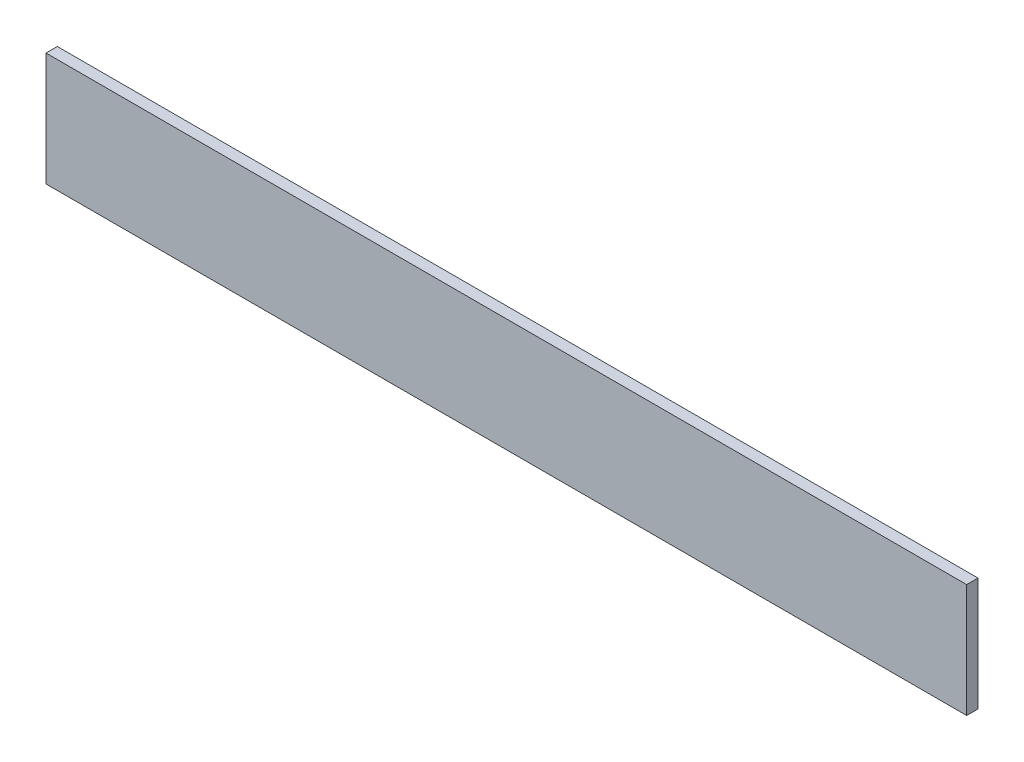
from build123d import *

# Parameters (mm, degrees)
ESQUISSE1_W      = 812
ESQUISSE1_H      = 100
EXTRUSION1_DEPTH = 10


with BuildPart() as part:
    # Esquisse1 → Extrusion1 (new body)
    with BuildSketch(Plane.XY):
        with Locations((406, -50)):
            Rectangle(ESQUISSE1_W, ESQUISSE1_H)
    extrude(amount=EXTRUSION1_DEPTH)


solid = part.part
